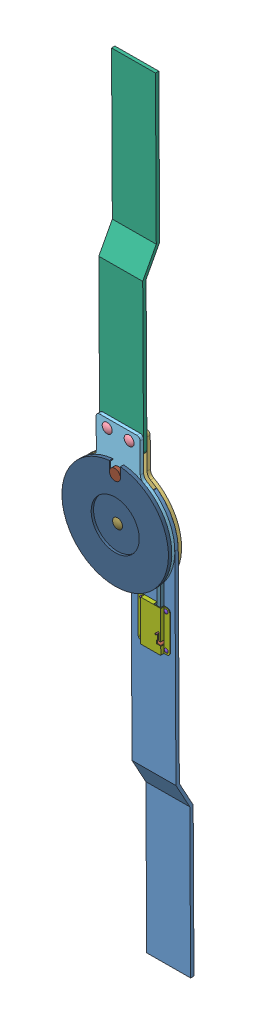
SolidWorks assembly bracehinge.SLDASM, configuration Default (file format 5000). Lengths in mm.
Overall size (81.52 575.99 17.9).
19 component instances, 14 part files, 42 mates.
Components (placement in the parent):
- middlepivot-3: middlepivot.SLDPRT [Default] at (-170.0324 36.6728 -74.5665) x (0.999985 0.005471 0) z (0 0 1) size (65.15 313.85 12.82)
- pawlcover-1: pawlcover.SLDPRT [Default] at (-145.6396 -10.2296 -76.5985) x (0.999985 0.005471 0) z (0 0 1) size (23.99 29.54 0.76)
- bottomratchet-2: bottomratchet.SLDPRT [Default] at (-170.465 47.4156 -78.3765) x (0.999985 0.005471 0) z (0 0 1) size (79.46 103.58 2.54)
- largescrew2-1: largescrew2.SLDPRT [Default] at (-178.598 94.0803 -70.7565) size (7.46 7.46 8.8)
- largescrew2-2: largescrew2.SLDPRT [Default] at (-162.0954 94.1706 -70.7565) size (7.46 7.46 8.8)
- topratchet-2: topratchet.SLDPRT [Default] at (-170.0324 36.6728 -73.2965) x (0.999985 0.005471 0) z (0 0 1) size (79.46 103.58 2.54)
- upperstrut-2: upperstrut.SLDPRT [Default] at (-170.4711 48.5369 -75.8365) x (0.999985 0.005471 0) z (0 0 1) size (33.01 243.43 12.82)
- pawltopcover-2: pawltopcover.SLDPRT [Default] at (-145.4914 -17.9724 -73.2965) x (0.999985 0.005471 0) z (0 0 1) size (23.99 30.56 3.05)
- smallscrew-2: smallscrew.SLDPRT [Default] at (-154.5606 -30.7031 -72.7885) size (2.99 2.99 4.23)
- smallscrew-3: smallscrew.SLDPRT [Default] at (-136.4222 -5.2417 -72.7885) size (2.99 2.99 4.23)
- smallscrew-4: smallscrew.SLDPRT [Default] at (-154.6994 -5.3417 -72.7885) size (2.99 2.99 4.23)
- smallscrew-5: smallscrew.SLDPRT [Default] at (-136.2834 -30.6031 -72.7885) size (2.99 2.99 4.23)
- smallscrew2-1: smallscrew2.SLDPRT [Default] at (-201.3168 27.5863 -70.7565) size (3.56 3.56 8.13)
- smallscrew2-2: smallscrew2.SLDPRT [Default] at (-153.0345 64.4639 -70.7565) size (3.56 3.56 8.13)
- cover-1: cover.SLDPRT [Default] at (-170.0324 36.6728 -68.8213) x (-0.999985 -0.005471 0) z (0 0 -1) size (80.01 79.8 2.54)
- largescrew-4: largescrew.SLDPRT [Default] at (-170.2106 69.2495 -70.7565) size (8.24 8.24 7.62)
- mainscrew-1: mainscrew.SLDPRT [Default] at (-170.0324 36.6728 -69.9945) size (7.46 7.46 9.56)
- slide-3: slide.SLDPRT [Default] at (-139.6627 -19.1965 -70.7565) x (0.999985 0.005471 0) z (0 0 1) size (2.54 3.05 5.26)
- pawl-2: pawl.SLDPRT [Default] at (-145.155 -11.134 -75.8365) x (0.999985 0.005471 0) z (0 0 1) size (14.18 34.11 7.62)
Mates (geometry in assembly coordinates):
- Coincident12: coincident: plane of middlepivot-3 through (-170.0324 36.6728 -75.8365) normal (0 0 -1); plane of pawlcover-1 through (-132.1182 -2.1644 -75.8365) normal (0 0 1)
- Coincident13: coincident: circle of middlepivot-3; circle of pawlcover-1
- Coincident16: coincident: plane of largescrew2-1 through (-182.3283 94.0803 -70.7565) normal (0 0 -1); plane of topratchet-2 through (-170.0324 36.6728 -70.7565) normal (0 0 1)
- Coincident19: coincident: cylinder of largescrew2-1 through (-178.598 94.0803 -78.3765) axis (0 0 1) radius 2.9925; circle of topratchet-2
- Coincident20: coincident: cylinder of largescrew2-2 through (-162.0954 94.1706 -78.3765) axis (0 0 1) radius 2.9925; circle of topratchet-2
- Coincident21: coincident: plane of largescrew2-2 through (-165.8257 94.1706 -70.7565) normal (0 0 -1); plane of topratchet-2 through (-170.0324 36.6728 -70.7565) normal (0 0 1)
- Coincident22: coincident: plane of middlepivot-3 through (-170.0324 36.6728 -73.2965) normal (0 0 1); plane of topratchet-2 through (-170.0324 36.6728 -73.2965) normal (0 0 -1)
- Coincident23: coincident: plane of middlepivot-3 through (-170.0324 36.6728 -75.8365) normal (0 0 -1); plane of bottomratchet-2 through (-170.465 47.4156 -75.8365) normal (0 0 1)
- Coincident24: coincident: circle of bottomratchet-2; cylinder of largescrew2-2 through (-162.0954 94.1706 -78.3765) axis (0 0 1) radius 2.9925
- Coincident27: coincident: plane of bottomratchet-2 through (-170.465 47.4156 -75.8365) normal (0 0 1); plane of upperstrut-2 through (-156.3587 89.5549 -75.8365) normal (0 0 -1)
- Coincident28: coincident: cylinder of largescrew2-2 through (-162.0954 94.1706 -78.3765) axis (0 0 1) radius 2.9925; circle of upperstrut-2
- Coincident30: coincident: plane of middlepivot-3 through (-170.0324 36.6728 -73.2965) normal (0 0 1); plane of pawltopcover-2 through (-134.336 -15.9536 -73.2965) normal (0 0 -1)
- Coincident31: coincident: plane of pawltopcover-2 through (-148.3457 -28.9446 -72.7885) normal (0 0 1); plane of smallscrew-2 through (-148.0366 -28.864 -72.7885) normal (0 0 -1)
- Coincident32: coincident: plane of pawltopcover-2 through (-148.3457 -28.9446 -72.7885) normal (0 0 1); plane of smallscrew-2 through (-148.0366 -28.864 -72.7885) normal (0 0 -1)
- Coincident33: coincident: circle of pawltopcover-2; cylinder of smallscrew-2 through (-148.0366 -28.864 -76.5985) axis (0 0 1) radius 1.0427
- Coincident34: coincident: plane of pawltopcover-2 through (-148.3457 -28.9446 -72.7885) normal (0 0 1); plane of smallscrew-5 through (-129.8571 -26.9746 -72.7885) normal (0 0 -1)
- Coincident35: coincident: plane of pawltopcover-2 through (-148.3457 -28.9446 -72.7885) normal (0 0 1); plane of smallscrew-3 through (-132.4789 -1.7486 -72.7885) normal (0 0 -1)
- Coincident36: coincident: plane of pawltopcover-2 through (-148.3457 -28.9446 -72.7885) normal (0 0 1); plane of smallscrew-4 through (-150.6585 -3.6381 -72.7885) normal (0 0 -1)
- Coincident37: coincident: circle of pawltopcover-2; cylinder of smallscrew-5 through (-129.8571 -26.9746 -76.5985) axis (0 0 1) radius 1.0427
- Coincident38: coincident: circle of pawltopcover-2; cylinder of smallscrew-3 through (-132.4789 -1.7486 -76.5985) axis (0 0 1) radius 1.0427
- Coincident39: coincident: circle of pawltopcover-2; cylinder of smallscrew-4 through (-150.6585 -3.6381 -76.5985) axis (0 0 1) radius 1.0427
- Coincident40: coincident: plane of topratchet-2 through (-170.0324 36.6728 -70.7565) normal (0 0 1); plane of smallscrew2-1 through (-201.3168 27.5863 -70.7565) normal (0 0 -1)
- Coincident41: coincident: circle of topratchet-2; cylinder of smallscrew2-1 through (-201.3168 27.5863 -78.3765) axis (0 0 1) radius 1.27
- Coincident42: coincident: plane of topratchet-2 through (-170.0324 36.6728 -70.7565) normal (0 0 1); plane of smallscrew2-2 through (-153.0345 64.4639 -70.7565) normal (0 0 -1)
- Coincident43: coincident: circle of topratchet-2; cylinder of smallscrew2-2 through (-153.0345 64.4639 -78.3765) axis (0 0 1) radius 1.27
- Coincident45: coincident: plane of topratchet-2 through (-170.0324 36.6728 -70.7565) normal (0 0 1); plane of largescrew-4 through (-170.2106 69.2495 -70.7565) normal (0 0 -1)
- Coincident46: coincident: circle of topratchet-2; cylinder of largescrew-4 through (-170.2106 69.2495 -75.8365) axis (0 0 1) radius 2.9925
- Coincident48: coincident: plane of cover-1 through (-151.9557 36.7717 -69.9945) normal (0 0 1); plane of mainscrew-1 through (-173.7627 36.6728 -69.9945) normal (0 0 -1)
- Coincident49: coincident: circle of cover-1; cylinder of mainscrew-1 through (-170.0324 36.6728 -78.3765) axis (0 0 1) radius 2.9925
- Coincident51: coincident: plane of topratchet-2 through (-170.0324 36.6728 -70.7565) normal (0 0 1); plane of cover-1 through (-170.0324 36.6728 -70.7565) normal (0 0 -1)
- Coincident62: coincident: circle of topratchet-2; cylinder of mainscrew-1 through (-170.0324 36.6728 -78.3765) axis (0 0 1) radius 2.9925
- Coincident53: coincident: circle of bottomratchet-2; cylinder of largescrew2-1 through (-178.598 94.0803 -78.3765) axis (0 0 1) radius 2.9925
- Coincident55: coincident: cylinder of largescrew2-1 through (-178.598 94.0803 -78.3765) axis (0 0 1) radius 2.9925; circle of upperstrut-2
- Tangent1: tangent: plane of cover-1 through (-166.0921 69.2721 -61.9633) normal (-0.999985 -0.005471 0); cylinder of largescrew-4 through (-170.2106 69.2495 -68.2165) axis (0 0 -1) radius 4.1185
- Concentric13: concentric: cylinder of middlepivot-3 through (-170.0324 36.6728 -73.2965) axis (0 0 -1) radius 2.9925; cylinder of mainscrew-1 through (-170.0324 36.6728 -78.3765) axis (0 0 1) radius 2.9925
- Coincident59: coincident: cylinder of middlepivot-3 through (-148.0366 -28.864 -73.2965) axis (0 0 -1) radius 1.0427; circle of pawlcover-1
- Coincident63: coincident: circle of pawlcover-1; circle of smallscrew-2
- Coincident64: coincident: circle of pawlcover-1; circle of smallscrew-4
- Hinge1: hinge: cylinder of slide-3 through (-133.8781 -20.3708 -72.0265) axis (-0.103377 0.994642 0) radius 0.254; cylinder of pawl-2 through (-133.8781 -20.3708 -72.0265) axis (-0.103377 0.994642 0) radius 0.254; plane of pawl-2 through (-132.6412 -19.9869 -73.2965) normal (-0.103377 0.994642 0); plane of slide-3 through (-132.6412 -19.9869 -73.2965) normal (0.103377 -0.994642 0); plane of pawl-2 through (-133.9044 -20.1182 -70.7565) normal (0 0 1); plane of slide-3 through (-134.0356 -18.855 -70.7565) normal (0 0 1)
- Coincident67: coincident: plane of pawltopcover-2 through (-134.336 -15.9536 -70.7565) normal (0 0 -1); plane of pawl-2 through (-133.9044 -20.1182 -70.7565) normal (0 0 1)
- Coincident68: coincident: plane of middlepivot-3 through (-141.3675 39.652 -73.2965) normal (0.994642 0.103377 0); plane of pawl-2 through (-137.1926 -0.5171 -70.7565) normal (-0.994642 -0.103377 0)
- PathMate2: path: point of ?
